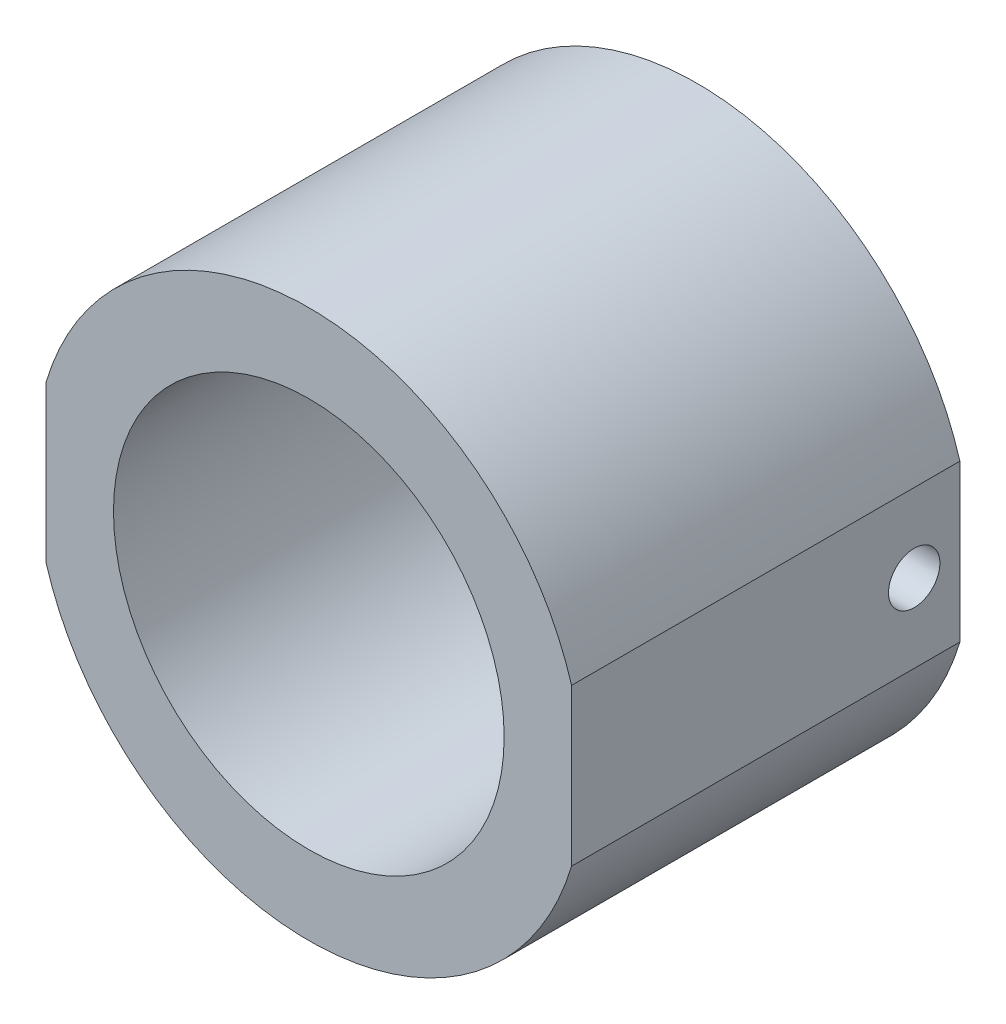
from build123d import *

# Parameters (mm, degrees)
SKETCH_1_R                             = 24
SKETCH_1_R_2                           = 17.1
WRIST_HOUSING_OD48_ID34_2_DEPTH        = 17
SKETCH_2_W                             = 14
SKETCH_2_H                             = 60
HOUSING_MOUNTING_FLATS_X23_DEPTH       = 250
SKETCH_3_R                             = 2.25
STATOR_SIDE_SCREW_CLEARANCE_D4_5_DEPTH = 250


with BuildPart() as part:
    # Sketch 1 → Wrist_Housing_OD48_ID34_2 (new, symmetric)
    with BuildSketch(Plane.XY):
        Circle(SKETCH_1_R)
        Circle(SKETCH_1_R_2, mode=Mode.SUBTRACT)
    extrude(amount=WRIST_HOUSING_OD48_ID34_2_DEPTH, both=True)

    # Sketch 2 → Housing_Mounting_Flats_X23 (cut, symmetric)
    with BuildSketch(Plane.XY):
        with Locations((30, 0)):
            Rectangle(SKETCH_2_W, SKETCH_2_H)
        with Locations((-30, 0)):
            Rectangle(SKETCH_2_W, SKETCH_2_H)
    extrude(amount=HOUSING_MOUNTING_FLATS_X23_DEPTH, both=True, mode=Mode.SUBTRACT)

    # Sketch 3 → Stator_Side_Screw_Clearance_D4_5 (cut, symmetric)
    with BuildSketch(Plane(origin=(0, 0, 0), x_dir=(0, 0, -1), z_dir=(1, 0, 0))):
        with Locations(Location((13, 0, 0), (0, 0, 180))):
            Circle(SKETCH_3_R)
    extrude(amount=STATOR_SIDE_SCREW_CLEARANCE_D4_5_DEPTH, both=True, mode=Mode.SUBTRACT)


solid = part.part
